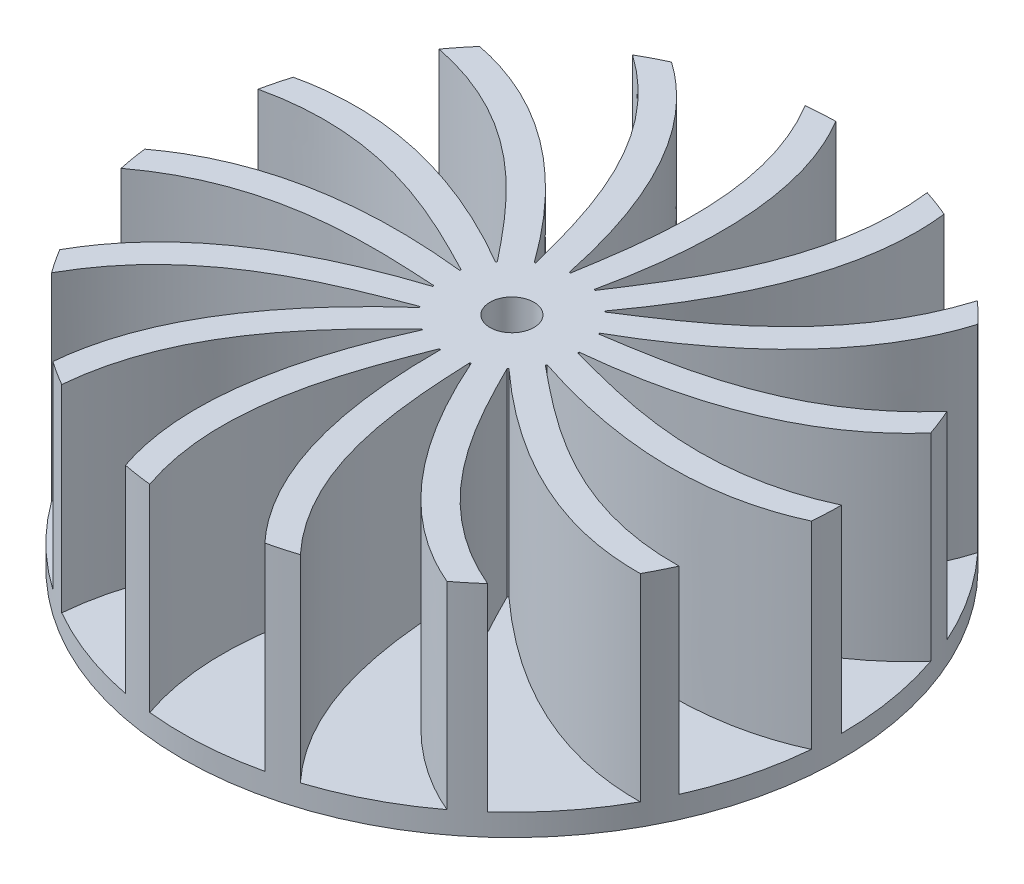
from build123d import *
from build123d.topology import SkipClean

# Parameters (mm, degrees)
SKETCH1_R               = 15
BOSS_EXTRUDE1_DEPTH     = 1
SKETCH2_R               = 3
BOSS_EXTRUDE2_DEPTH     = 9
BOSS_EXTRUDE3_DEPTH     = 9
CUT_EXTRUDE1_DEPTH      = 24.45207897
CUT_EXTRUDE1_DEPTH_BACK = 24.45207897
SKETCH5_R               = 1


with BuildPart() as part:
    # Sketch1 → Boss-Extrude1 (new body)
    with BuildSketch(Plane(origin=(0, 0, 0), x_dir=(1, 0, 0), z_dir=(0, 1, 0))):
        with Locations(Location((0, 0, 0), (0, 0, 270))):
            Circle(SKETCH1_R)
    extrude(amount=BOSS_EXTRUDE1_DEPTH)

    # Sketch2 → Boss-Extrude2 (add)
    with BuildSketch(Plane(origin=(0, 1, 0), x_dir=(1, 0, 0), z_dir=(0, 1, 0))):
        with Locations(Location((0, 0, 0), (0, 0, 270))):
            Circle(SKETCH2_R)
    extrude(amount=BOSS_EXTRUDE2_DEPTH)

    # Sketch4 → Boss-Extrude3 (add)
    with SkipClean():  # the faces are left unmerged after this step: merging them gives an invalid solid
        with BuildSketch(Plane(origin=(0, 1, 0), x_dir=(1, 0, 0), z_dir=(0, 1, 0))):
            with BuildLine():
                ThreePointArc((15, 0), (14.985622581, -0.656594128), (14.942517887, -1.311929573))
                add(Edge.make_bspline(
                    [(2.764538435, -1.16504388), (10.068270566, -3.576587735), (14.942517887, -1.311929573)],
                    knots=[0, 0, 0, 1, 1, 1], degree=2))
                ThreePointArc((2.764538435, -1.16504388), (2.940545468, -0.59429988), (3, 0))
                add(Edge.make_bspline(
                    [(3, 0), (6.042851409, -0.828316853), (10.492705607, -2.094165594), (15, 0)],
                    knots=[0, 0, 0, 0, 1, 1, 1, 1], degree=3))
            make_face()
            with BuildLine():
                ThreePointArc((2.051665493, -2.188759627), (2.444598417, -1.738947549), (2.740636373, -1.220209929))
                add(Edge.make_bspline(
                    [(2.740636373, -1.220209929), (5.183512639, -3.214554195), (8.733789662, -6.180883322), (13.703181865, -6.101049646)],
                    knots=[0, 0, 0, 0, 1, 1, 1, 1], degree=3))
                ThreePointArc((13.703181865, -6.101049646), (13.422986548, -6.695030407), (13.117059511, -7.276176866))
                add(Edge.make_bspline(
                    [(2.051665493, -2.188759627), (7.743093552, -7.362510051), (13.117059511, -7.276176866)],
                    knots=[0, 0, 0, 1, 1, 1], degree=2))
            make_face()
            with BuildLine():
                ThreePointArc((0.984040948, -2.834018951), (1.525958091, -2.582915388), (2.007391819, -2.229434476))
                add(Edge.make_bspline(
                    [(2.007391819, -2.229434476), (3.427897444, -5.044965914), (5.46472214, -9.198870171), (10.036959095, -11.147172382)],
                    knots=[0, 0, 0, 0, 1, 1, 1, 1], degree=3))
                ThreePointArc((10.036959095, -11.147172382), (9.539394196, -11.575835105), (9.023542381, -11.982307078))
                add(Edge.make_bspline(
                    [(0.984040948, -2.834018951), (4.07906532, -9.875387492), (9.023542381, -11.982307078)],
                    knots=[0, 0, 0, 1, 1, 1], degree=2))
            make_face()
            with BuildLine():
                ThreePointArc((-0.253733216, -2.989250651), (0.343465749, -2.980273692), (0.927050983, -2.853169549))
                add(Edge.make_bspline(
                    [(0.927050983, -2.853169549), (1.079567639, -6.003057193), (1.250754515, -10.626288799), (4.635254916, -14.265847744)],
                    knots=[0, 0, 0, 0, 1, 1, 1, 1], degree=3))
                ThreePointArc((4.635254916, -14.265847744), (4.006353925, -14.455072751), (3.369772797, -14.616587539))
                add(Edge.make_bspline(
                    [(-0.253733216, -2.989250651), (-0.290270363, -10.680720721), (3.369772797, -14.616587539)],
                    knots=[0, 0, 0, 1, 1, 1], degree=2))
            make_face()
            with BuildLine():
                ThreePointArc((-1.447634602, -2.627613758), (-0.898414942, -2.8623156), (-0.31358539, -2.983565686))
                add(Edge.make_bspline(
                    [(-0.31358539, -2.983565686), (-1.455429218, -5.923165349), (-3.179479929, -10.216325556), (-1.567926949, -14.917828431)],
                    knots=[0, 0, 0, 0, 1, 1, 1, 1], degree=3))
                ThreePointArc((-1.567926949, -14.917828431), (-2.219421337, -14.834896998), (-2.866661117, -14.723527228))
                add(Edge.make_bspline(
                    [(-1.447634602, -2.627613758), (-4.609415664, -9.639260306), (-2.866661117, -14.723527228)],
                    knots=[0, 0, 0, 1, 1, 1], degree=2))
            make_face()
            with BuildLine():
                ThreePointArc((-2.391226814, -1.811638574), (-1.984951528, -2.249437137), (-1.5, -2.598076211))
                add(Edge.make_bspline(
                    [(-1.5, -2.598076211), (-3.738769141, -4.819104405), (-7.059953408, -8.039866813), (-7.5, -12.990381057)],
                    knots=[0, 0, 0, 0, 1, 1, 1, 1], degree=3))
                ThreePointArc((-7.5, -12.990381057), (-8.061438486, -12.649632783), (-8.607423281, -12.2846353))
                add(Edge.make_bspline(
                    [(-2.391226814, -1.811638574), (-8.13155112, -6.931084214), (-8.607423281, -12.2846353)],
                    knots=[0, 0, 0, 1, 1, 1], degree=2))
            make_face()
            with BuildLine():
                ThreePointArc((-2.921354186, -0.682414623), (-2.728271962, -1.247610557), (-2.427050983, -1.763355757))
                add(Edge.make_bspline(
                    [(-2.427050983, -1.763355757), (-5.375641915, -2.881776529), (-9.719696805, -4.473242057), (-12.135254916, -8.816778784)],
                    knots=[0, 0, 0, 0, 1, 1, 1, 1], degree=3))
                ThreePointArc((-12.135254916, -8.816778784), (-12.509559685, -8.277132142), (-12.859883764, -7.721618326))
                add(Edge.make_bspline(
                    [(-2.921354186, -0.682414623), (-10.247667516, -3.024460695), (-12.859883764, -7.721618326)],
                    knots=[0, 0, 0, 1, 1, 1], degree=2))
            make_face()
            with BuildLine():
                ThreePointArc((-2.94635288, 0.564805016), (-2.999849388, -0.030060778), (-2.934442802, -0.623735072))
                add(Edge.make_bspline(
                    [(-2.934442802, -0.623735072), (-6.083017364, -0.446163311), (-10.698816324, -0.133153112), (-14.672214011, -3.118675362)],
                    knots=[0, 0, 0, 0, 1, 1, 1, 1], degree=3))
                ThreePointArc((-14.672214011, -3.118675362), (-14.794664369, -2.473440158), (-14.888753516, -1.823463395))
                add(Edge.make_bspline(
                    [(-2.94635288, 0.564805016), (-10.591869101, 1.405119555), (-14.888753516, -1.823463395)],
                    knots=[0, 0, 0, 1, 1, 1], degree=2))
            make_face()
            with BuildLine():
                ThreePointArc((-2.461900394, 1.714364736), (-2.752725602, 1.192686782), (-2.934442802, 0.623735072))
                add(Edge.make_bspline(
                    [(-2.934442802, 0.623735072), (-5.738583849, 2.066595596), (-9.828013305, 4.229959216), (-14.672214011, 3.118675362)],
                    knots=[0, 0, 0, 0, 1, 1, 1, 1], degree=3))
                ThreePointArc((-14.672214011, 3.118675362), (-14.521637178, 3.7579321), (-14.343222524, 4.389984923))
                add(Edge.make_bspline(
                    [(-2.461900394, 1.714364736), (-9.104640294, 5.591741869), (-14.343222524, 4.389984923)],
                    knots=[0, 0, 0, 1, 1, 1], degree=2))
            make_face()
            with BuildLine():
                ThreePointArc((-1.551762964, 2.56749522), (-2.029630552, 2.209207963), (-2.427050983, 1.763355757))
                add(Edge.make_bspline(
                    [(-2.427050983, 1.763355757), (-4.401897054, 4.222021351), (-7.257857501, 7.861673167), (-12.135254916, 8.816778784)],
                    knots=[0, 0, 0, 0, 1, 1, 1, 1], degree=3))
                ThreePointArc((-12.135254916, 8.816778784), (-11.737686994, 9.339523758), (-11.317618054, 9.844364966))
                add(Edge.make_bspline(
                    [(-1.551762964, 2.56749522), (-6.043136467, 8.811501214), (-11.317618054, 9.844364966)],
                    knots=[0, 0, 0, 1, 1, 1], degree=2))
            make_face()
            with BuildLine():
                ThreePointArc((-0.373311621, 2.976682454), (-0.95559394, 2.843737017), (-1.5, 2.598076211))
                add(Edge.make_bspline(
                    [(-1.5, 2.598076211), (-2.304082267, 5.647421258), (-3.432752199, 10.134032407), (-7.5, 12.990381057)],
                    knots=[0, 0, 0, 0, 1, 1, 1, 1], degree=3))
                ThreePointArc((-7.5, 12.990381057), (-6.924184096, 13.306226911), (-6.335094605, 13.596564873))
                add(Edge.make_bspline(
                    [(-0.373311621, 2.976682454), (-1.936719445, 10.50767195), (-6.335094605, 13.596564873)],
                    knots=[0, 0, 0, 1, 1, 1], degree=2))
            make_face()
            with BuildLine():
                ThreePointArc((0.869688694, 2.87117425), (0.283673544, 2.986558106), (-0.31358539, 2.983565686))
                add(Edge.make_bspline(
                    [(-0.31358539, 2.983565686), (0.192129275, 6.096330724), (0.985907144, 10.654125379), (-1.567926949, 14.917828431)],
                    knots=[0, 0, 0, 0, 1, 1, 1, 1], degree=3))
                ThreePointArc((-1.567926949, 14.917828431), (-0.913426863, 14.972162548), (-0.257175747, 14.997795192))
                add(Edge.make_bspline(
                    [(0.869688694, 2.87117425), (2.504573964, 10.386970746), (-0.257175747, 14.997795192)],
                    knots=[0, 0, 0, 1, 1, 1], degree=2))
            make_face()
            with BuildLine():
                ThreePointArc((1.962311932, 2.269213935), (1.473891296, 2.612976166), (0.927050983, 2.853169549))
                add(Edge.make_bspline(
                    [(0.927050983, 2.853169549), (2.65511992, 5.491129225), (5.234094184, 9.332023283), (4.635254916, 14.265847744)],
                    knots=[0, 0, 0, 0, 1, 1, 1, 1], degree=3))
                ThreePointArc((4.635254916, 14.265847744), (5.255270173, 14.049275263), (5.865211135, 13.805770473))
                add(Edge.make_bspline(
                    [(1.962311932, 2.269213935), (6.512803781, 8.470267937), (5.865211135, 13.805770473)],
                    knots=[0, 0, 0, 1, 1, 1], degree=2))
            make_face()
            with BuildLine():
                ThreePointArc((2.71563361, 1.274885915), (2.409259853, 1.78758691), (2.007391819, 2.229434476))
                add(Edge.make_bspline(
                    [(2.007391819, 2.229434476), (4.65901621, 3.936461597), (8.57725879, 6.396329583), (10.036959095, 11.147172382)],
                    knots=[0, 0, 0, 0, 1, 1, 1, 1], degree=3))
                ThreePointArc((10.036959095, 11.147172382), (10.515283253, 10.697140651), (10.973449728, 10.226602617))
                add(Edge.make_bspline(
                    [(2.71563361, 1.274885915), (9.394910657, 5.088978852), (10.973449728, 10.226602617)],
                    knots=[0, 0, 0, 1, 1, 1], degree=2))
            make_face()
            with BuildLine():
                ThreePointArc((2.999397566, 0.060118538), (2.928045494, 0.653107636), (2.740636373, 1.220209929))
                add(Edge.make_bspline(
                    [(2.740636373, 1.220209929), (5.857326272, 1.701143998), (10.437337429, 2.354652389), (13.703181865, 6.101049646)],
                    knots=[0, 0, 0, 0, 1, 1, 1, 1], degree=3))
                ThreePointArc((13.703181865, 6.101049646), (13.957108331, 5.49537324), (14.184279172, 4.879162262))
                add(Edge.make_bspline(
                    [(2.999397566, 0.060118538), (10.652552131, 0.827759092), (14.184279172, 4.879162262)],
                    knots=[0, 0, 0, 1, 1, 1], degree=2))
            make_face()
        extrude(amount=BOSS_EXTRUDE3_DEPTH)

    # Sketch5 → Cut-Extrude1 (cut, two sides: drawn at the far end of the back side and taken through both)
    with SkipClean():  # the faces are left unmerged after this step: merging them gives an invalid solid
        with BuildSketch(Plane.XZ.offset(-CUT_EXTRUDE1_DEPTH_BACK)):
            with Locations(Location((0, 0, 0), (0, 0, 270))):
                Circle(SKETCH5_R)
        extrude(amount=CUT_EXTRUDE1_DEPTH + CUT_EXTRUDE1_DEPTH_BACK, mode=Mode.SUBTRACT)


solid = part.part
